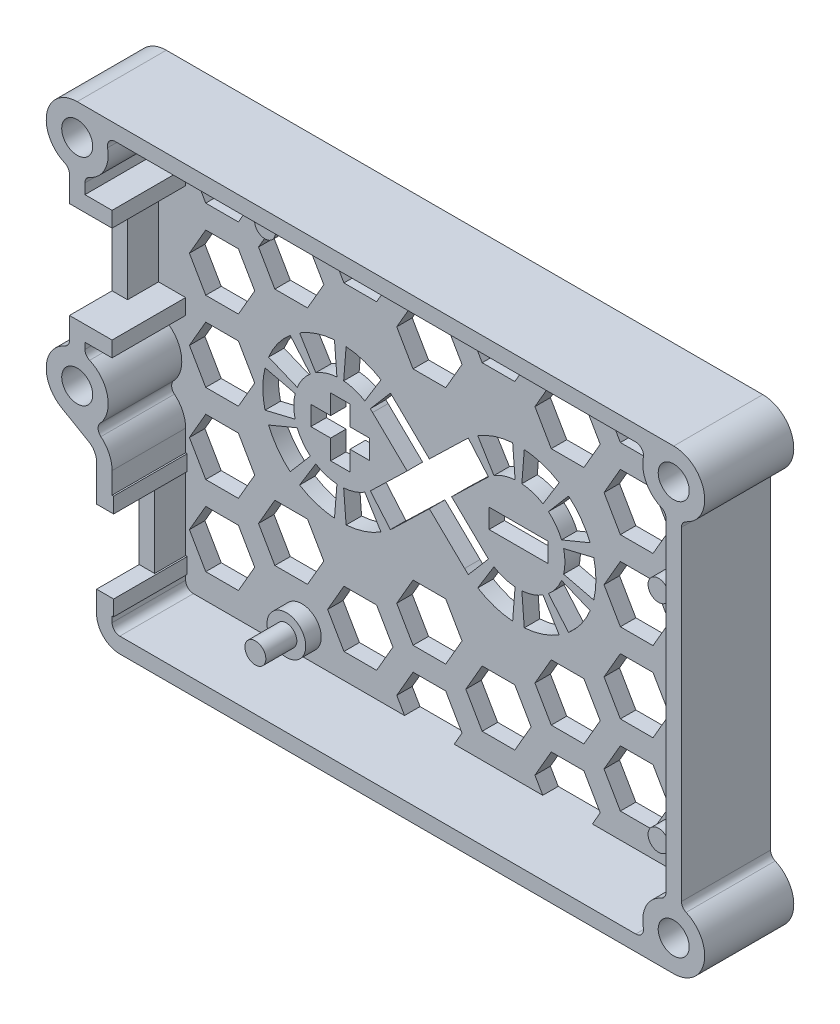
from build123d import *

# Parameters (mm, degrees)
ESQUISSE2_R             = 2
BOSS_EXTRU_1_DEPTH      = 2
ESQUISSE10_R            = 1
ENL_V_MAT_EXTRU_3_DEPTH = 52.806385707
ESQUISSE3_R             = 2
BOSS_EXTRU_2_DEPTH      = 9.5
BOSS_EXTRU_3_START      = 2
ESQUISSE4_R             = 2.5
ESQUISSE4_R_2           = 1
BOSS_EXTRU_3_DEPTH      = 2
ESQUISSE6_W             = 2
ESQUISSE6_H             = 12.5
ESQUISSE6_H_2           = 9.5
ENL_V_MAT_EXTRU_1_DEPTH = 5.5
ESQUISSE7_W             = 3.5
ESQUISSE7_H             = 2
ESQUISSE7_W_2           = 0.2
BOSS_EXTRU_4_DEPTH      = 9.5
ENL_V_MAT_EXTRU_2_DEPTH = 53.63222967
ESQUISSE13_W            = 7.599342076
ESQUISSE13_H            = 2.5
ENL_V_MAT_EXTRU_8_DEPTH = 54.029723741
ESQUISSE16_R            = 1.35
BOSS_EXTRU_5_DEPTH      = 8


with BuildPart() as part:
    # Esquisse2 → Boss.-Extru.1 (new body)
    with BuildSketch(Plane.XY):
        with BuildLine():
            Line((-40.54, -5.74722325), (-37.04, -7.767949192))
            ThreePointArc((-37.04, -7.767949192), (-36.307949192, -8.5), (-36.04, -9.5))
            Line((-36.04, -9.5), (-36.04, -26.5))
            ThreePointArc((-36.04, -26.5), (-35.161320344, -28.621320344), (-33.04, -29.5))
            Line((-33.04, -29.5), (5.406709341, -29.5))
            Line((5.406709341, -29.5), (38.46, -29.5))
            ThreePointArc((38.46, -29.5), (42.375625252, -26.317238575), (40.06, -21.833939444))
            ThreePointArc((40.06, -21.833939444), (39.623339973, -21.465146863), (39.46, -20.917424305))
            Line((39.46, -20.917424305), (39.46, 20.917424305))
            ThreePointArc((39.46, 20.917424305), (39.623339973, 21.465146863), (40.06, 21.833939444))
            ThreePointArc((40.06, 21.833939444), (42.375625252, 26.317238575), (38.46, 29.5))
            Line((38.46, 29.5), (-38.54, 29.5))
            ThreePointArc((-38.54, 29.5), (-42.455625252, 26.317238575), (-40.14, 21.833939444))
            ThreePointArc((-40.14, 21.833939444), (-39.703339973, 21.465146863), (-39.54, 20.917424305))
            Line((-39.54, 20.917424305), (-39.54, 2.29945406))
            ThreePointArc((-39.54, 2.29945406), (-39.703339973, 1.751731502), (-40.14, 1.382938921))
            ThreePointArc((-40.14, 1.382938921), (-42.533720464, -2.059075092), (-40.54, -5.74722325))
        make_face()
        with Locations((-38.54, 25.5)):
            Circle(ESQUISSE2_R, mode=Mode.SUBTRACT)
        with Locations((-38.54, -2.283121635)):
            Circle(ESQUISSE2_R, mode=Mode.SUBTRACT)
        with Locations(Location((38.46, 25.5, 0), (0, 0, 180))):
            Circle(ESQUISSE2_R, mode=Mode.SUBTRACT)
        with Locations((38.46, -25.5)):
            Circle(ESQUISSE2_R, mode=Mode.SUBTRACT)
    extrude(amount=BOSS_EXTRU_1_DEPTH)

    # Esquisse10 → Enl_v. mat.-Extru.3 (cut, through all)
    with BuildSketch(Plane.XY.offset(2)):
        with Locations((-17.8, 24.13)):
            Circle(ESQUISSE10_R)
        with Locations((33, 8.89)):
            Circle(ESQUISSE10_R)
        with Locations((33, -19.05)):
            Circle(ESQUISSE10_R)
        with Locations((-19.04, -24.13)):
            Circle(ESQUISSE10_R)
    extrude(amount=-ENL_V_MAT_EXTRU_3_DEPTH, mode=Mode.SUBTRACT)

    # Esquisse3 → Boss.-Extru.2 (add)
    with BuildSketch(Plane.XY.offset(2)):
        with BuildLine():
            Line((-39.54, 20.917424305), (-39.54, 2.29945406))
            ThreePointArc((-39.54, 2.29945406), (-39.703339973, 1.751731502), (-40.14, 1.382938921))
            ThreePointArc((-40.14, 1.382938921), (-42.533720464, -2.059075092), (-40.54, -5.74722325))
            Line((-40.54, -5.74722325), (-37.04, -7.767949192))
            ThreePointArc((-37.04, -7.767949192), (-36.307949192, -8.5), (-36.04, -9.5))
            Line((-36.04, -9.5), (-36.04, -26.5))
            ThreePointArc((-36.04, -26.5), (-35.161320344, -28.621320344), (-33.04, -29.5))
            Line((-33.04, -29.5), (38.46, -29.5))
            ThreePointArc((38.46, -29.5), (42.375625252, -26.317238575), (40.06, -21.833939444))
            ThreePointArc((40.06, -21.833939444), (39.623339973, -21.465146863), (39.46, -20.917424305))
            Line((39.46, -20.917424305), (39.46, 20.917424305))
            ThreePointArc((39.46, 20.917424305), (39.623339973, 21.465146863), (40.06, 21.833939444))
            ThreePointArc((40.06, 21.833939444), (42.375625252, 26.317238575), (38.46, 29.5))
            Line((38.46, 29.5), (-38.54, 29.5))
            ThreePointArc((-38.54, 29.5), (-42.455625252, 26.317238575), (-40.14, 21.833939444))
            ThreePointArc((-40.14, 21.833939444), (-39.703339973, 21.465146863), (-39.54, 20.917424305))
        make_face()
        with Locations((-38.54, 25.5)):
            Circle(ESQUISSE3_R, mode=Mode.SUBTRACT)
        with Locations(Location((38.46, 25.5, 0), (0, 0, 180))):
            Circle(ESQUISSE3_R, mode=Mode.SUBTRACT)
        with Locations((38.46, -25.5)):
            Circle(ESQUISSE3_R, mode=Mode.SUBTRACT)
        with Locations((-38.54, -2.283121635)):
            Circle(ESQUISSE3_R, mode=Mode.SUBTRACT)
        with BuildLine():
            Line((-37.54, 20.917424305), (-37.54, 2.29945406))
            ThreePointArc((-37.54, 2.29945406), (-37.376660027, 1.751731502), (-36.94, 1.382938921))
            ThreePointArc((-36.94, 1.382938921), (-34.627755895, -1.449847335), (-35.584962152, -4.97899836))
            ThreePointArc((-35.584962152, -4.97899836), (-35.843811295, -5.722083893), (-35.484962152, -6.422374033))
            ThreePointArc((-35.484962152, -6.422374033), (-34.419216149, -7.800022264), (-34.04, -9.5))
            Line((-34.04, -9.5), (-34.04, -26.5))
            ThreePointArc((-34.04, -26.5), (-33.747106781, -27.207106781), (-33.04, -27.5))
            Line((-33.04, -27.5), (5.406709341, -27.5))
            Line((5.406709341, -27.5), (33.561020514, -27.5))
            ThreePointArc((33.561020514, -27.5), (34.335617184, -27.132455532), (34.540816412, -26.3))
            ThreePointArc((34.540816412, -26.3), (34.910102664, -23.656571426), (36.86, -21.833939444))
            ThreePointArc((36.86, -21.833939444), (37.296660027, -21.465146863), (37.46, -20.917424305))
            Line((37.46, -20.917424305), (37.46, 20.917424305))
            ThreePointArc((37.46, 20.917424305), (37.296660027, 21.465146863), (36.86, 21.833939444))
            ThreePointArc((36.86, 21.833939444), (34.910102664, 23.656571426), (34.540816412, 26.3))
            ThreePointArc((34.540816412, 26.3), (34.335617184, 27.132455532), (33.561020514, 27.5))
            Line((33.561020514, 27.5), (-33.641020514, 27.5))
            ThreePointArc((-33.641020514, 27.5), (-34.415617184, 27.132455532), (-34.620816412, 26.3))
            ThreePointArc((-34.620816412, 26.3), (-34.990102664, 23.656571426), (-36.94, 21.833939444))
            ThreePointArc((-36.94, 21.833939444), (-37.376660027, 21.465146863), (-37.54, 20.917424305))
        make_face(mode=Mode.SUBTRACT)
    extrude(amount=BOSS_EXTRU_2_DEPTH)

    # Esquisse4 → Boss.-Extru.3 (add)
    # profile 1 of 4: a face of its own
    with BuildSketch(Plane.XY.offset(2).offset(BOSS_EXTRU_3_START)):
        with Locations(Location((-17.8, 24.13, 0), (0, 0, 180))):
            Circle(ESQUISSE4_R)
        with Locations((-17.8, 24.13)):
            Circle(ESQUISSE4_R_2, mode=Mode.SUBTRACT)
    # profile 2 of 4: a face of its own
    with BuildSketch(Plane.XY.offset(2).offset(BOSS_EXTRU_3_START)):
        with Locations(Location((-19.04, -24.13, 0), (0, 0, 180))):
            Circle(ESQUISSE4_R)
        with Locations((-19.04, -24.13)):
            Circle(ESQUISSE4_R_2, mode=Mode.SUBTRACT)
    # profile 3 of 4: a face of its own
    with BuildSketch(Plane.XY.offset(2).offset(BOSS_EXTRU_3_START)):
        with Locations(Location((33, 8.89, 0), (0, 0, 180))):
            Circle(ESQUISSE4_R)
        with Locations((33, 8.89)):
            Circle(ESQUISSE4_R_2, mode=Mode.SUBTRACT)
    # profile 4 of 4: a face of its own
    with BuildSketch(Plane.XY.offset(2).offset(BOSS_EXTRU_3_START)):
        with Locations(Location((33, -19.05, 0), (0, 0, 180))):
            Circle(ESQUISSE4_R)
        with Locations((33, -19.05)):
            Circle(ESQUISSE4_R_2, mode=Mode.SUBTRACT)
    extrude(amount=-BOSS_EXTRU_3_DEPTH)

    # Esquisse6 → Enl_v. mat.-Extru.1 (cut)
    with BuildSketch(Plane.XY.offset(11.5)):
        with Locations((-38.54, 11.35)):
            Rectangle(ESQUISSE6_W, ESQUISSE6_H)
        with Locations((-35.04, -19)):
            Rectangle(ESQUISSE6_W, ESQUISSE6_H_2)
    extrude(amount=-ENL_V_MAT_EXTRU_1_DEPTH, mode=Mode.SUBTRACT)

    # Esquisse7 → Boss.-Extru.4 (add)
    with BuildSketch(Plane.XY.offset(2)):
        with Locations((-35.79, 18.6)):
            Rectangle(ESQUISSE7_W, ESQUISSE7_H)
        with Locations((-35.79, 4.1)):
            Rectangle(ESQUISSE7_W, ESQUISSE7_H)
        with Locations((-33.94, -13.25)):
            Rectangle(ESQUISSE7_W_2, ESQUISSE7_H)
        with Locations((-33.94, -24.75)):
            Rectangle(ESQUISSE7_W_2, ESQUISSE7_H)
    extrude(amount=BOSS_EXTRU_4_DEPTH)

    # Esquisse9 → Enl_v. mat.-Extru.2 (cut, through all)
    with BuildSketch(Plane.XY.offset(2)):
        Polygon((-27.232794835, -16.95), (-31.447451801, -16.95), (-33.554780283, -20.6), (-31.447451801, -24.25), (-27.232794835, -24.25), (-25.125466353, -20.6), align=None)
        Polygon((-22.527390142, -19.1), (-18.312733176, -19.1), (-16.205404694, -15.45), (-18.312733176, -11.8), (-22.527390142, -11.8), (-24.634718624, -15.45), align=None)
        Polygon((-13.607328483, -16.95), (-15.714656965, -20.6), (-13.607328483, -24.25), (-9.392671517, -24.25), (-7.285343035, -20.6), (-9.392671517, -16.95), align=None)
        Polygon((-27.232794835, -13.95), (-25.125466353, -10.3), (-27.232794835, -6.65), (-31.447451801, -6.65), (-33.554780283, -10.3), (-31.447451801, -13.95), align=None)
        Polygon((-27.232794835, -3.65), (-25.125466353, 0), (-27.232794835, 3.65), (-31.447451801, 3.65), (-33.554780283, 0), (-31.447451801, -3.65), align=None)
        Polygon((-27.232794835, 6.65), (-25.125466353, 10.3), (-27.232794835, 13.95), (-31.447451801, 13.95), (-33.554780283, 10.3), (-31.447451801, 6.65), align=None)
        Polygon((-27.232794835, 16.95), (-25.125466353, 20.6), (-27.232794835, 24.25), (-31.447451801, 24.25), (-33.554780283, 20.6), (-31.447451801, 16.95), align=None)
        Polygon((-22.527390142, 19.1), (-24.634718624, 15.45), (-22.527390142, 11.8), (-18.312733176, 11.8), (-16.205404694, 15.45), (-18.312733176, 19.1), align=None)
        Polygon((-15.714656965, 20.6), (-13.607328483, 16.95), (-9.392671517, 16.95), (-7.285343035, 20.6), (-9.392671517, 24.25), (-13.607328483, 24.25), align=None)
        Polygon((-4.687266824, 19.1), (-6.794595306, 15.45), (-4.687266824, 11.8), (-0.472609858, 11.8), (1.634718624, 15.45), (-0.472609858, 19.1), align=None)
        Polygon((2.125466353, 20.6), (4.232794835, 16.95), (8.447451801, 16.95), (10.554780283, 20.6), (8.447451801, 24.25), (4.232794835, 24.25), align=None)
        Polygon((13.152856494, 19.1), (11.045528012, 15.45), (13.152856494, 11.8), (17.367513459, 11.8), (19.474841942, 15.45), (17.367513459, 19.1), align=None)
        Polygon((-6.794595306, -15.45), (-4.687266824, -19.1), (-0.472609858, -19.1), (1.634718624, -15.45), (-0.472609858, -11.8), (-4.687266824, -11.8), align=None)
        Polygon((2.125466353, -20.6), (4.232794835, -24.25), (8.447451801, -24.25), (10.554780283, -20.6), (8.447451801, -16.95), (4.232794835, -16.95), align=None)
        Polygon((19.965589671, -20.6), (22.072918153, -24.25), (26.287575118, -24.25), (28.394903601, -20.6), (26.287575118, -16.95), (22.072918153, -16.95), align=None)
        Polygon((17.367513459, -19.1), (19.474841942, -15.45), (17.367513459, -11.8), (13.152856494, -11.8), (11.045528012, -15.45), (13.152856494, -19.1), align=None)
        Polygon((22.072918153, -13.95), (26.287575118, -13.95), (28.394903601, -10.3), (26.287575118, -6.65), (22.072918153, -6.65), (19.965589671, -10.3), align=None)
        Polygon((19.965589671, 20.6), (22.072918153, 16.95), (26.287575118, 16.95), (28.394903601, 20.6), (26.287575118, 24.25), (22.072918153, 24.25), align=None)
        Polygon((22.072918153, 13.95), (19.965589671, 10.3), (22.072918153, 6.65), (26.287575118, 6.65), (28.394903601, 10.3), (26.287575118, 13.95), align=None)
        Polygon((22.072918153, 3.65), (19.965589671, 0), (22.072918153, -3.65), (26.287575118, -3.65), (28.394903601, 0), (26.287575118, 3.65), align=None)
        Polygon((30.992979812, -8.8), (35.207636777, -8.8), (37.31496526, -5.15), (35.207636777, -1.5), (30.992979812, -1.5), (28.88565133, -5.15), align=None)
        Polygon((0.624355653, -27.5), (-5.784232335, -27.5), (-6.794595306, -25.75), (-4.687266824, -22.1), (-0.472609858, -22.1), (1.634718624, -25.75), align=None)
        Polygon((12.055890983, -27.5), (18.464478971, -27.5), (19.474841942, -25.75), (17.367513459, -22.1), (13.152856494, -22.1), (11.045528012, -25.75), align=None)
        Polygon((-6.794595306, 25.75), (-4.687266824, 22.1), (-0.472609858, 22.1), (1.634718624, 25.75), (0.624355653, 27.5), (-5.784232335, 27.5), align=None)
        Polygon((12.055890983, 27.5), (18.464478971, 27.5), (19.474841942, 25.75), (17.367513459, 22.1), (13.152856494, 22.1), (11.045528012, 25.75), align=None)
    extrude(amount=-ENL_V_MAT_EXTRU_2_DEPTH, mode=Mode.SUBTRACT)

    # Esquisse13 → Enl_v. mat.-Extru.8 (cut, through all)
    with BuildSketch(Plane(origin=(0, 0, 0), x_dir=(1, 0, 0), z_dir=(0, 0, -1))):
        with BuildLine():
            Line((4.746148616, -4.310272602), (0.295061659, 0))
            Line((0.295061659, 0), (4.746148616, 4.310272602))
            ThreePointArc((4.746148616, 4.310272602), (4.895865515, 4.450375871), (5.050282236, 4.585281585))
            Line((5.050282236, 4.585281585), (2.452001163, 7.626545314))
            ThreePointArc((2.452001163, 7.626545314), (2.204120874, 7.409192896), (1.96353992, 7.18378767))
            Line((1.96353992, 7.18378767), (-2.579938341, 2.78404665))
            Line((-2.579938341, 2.78404665), (-7.123416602, 7.18378767))
            ThreePointArc((-7.123416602, 7.18378767), (-7.363997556, 7.409192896), (-7.611877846, 7.626545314))
            Line((-7.611877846, 7.626545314), (-10.210158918, 4.585281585))
            ThreePointArc((-10.210158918, 4.585281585), (-10.055742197, 4.450375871), (-9.906025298, 4.310272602))
            Line((-9.906025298, 4.310272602), (-5.454938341, 0))
            Line((-5.454938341, 0), (-9.906025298, -4.310272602))
            ThreePointArc((-9.906025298, -4.310272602), (-10.055742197, -4.450375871), (-10.210158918, -4.585281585))
            Line((-10.210158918, -4.585281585), (-7.611877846, -7.626545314))
            ThreePointArc((-7.611877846, -7.626545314), (-7.363997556, -7.409192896), (-7.123416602, -7.18378767))
            Line((-7.123416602, -7.18378767), (-2.579938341, -2.78404665))
            Line((-2.579938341, -2.78404665), (1.96353992, -7.18378767))
            ThreePointArc((1.96353992, -7.18378767), (2.204120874, -7.409192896), (2.452001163, -7.626545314))
            Line((2.452001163, -7.626545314), (5.050282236, -4.585281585))
            ThreePointArc((5.050282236, -4.585281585), (4.895865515, -4.450375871), (4.746148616, -4.310272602))
        make_face()
        with BuildLine():
            Line((9.670061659, -9.971835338), (9.355618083, -5.984170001))
            ThreePointArc((9.355618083, -5.984170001), (10.774163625, -5.706339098), (12.085095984, -5.097308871))
            Line((12.085095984, -5.097308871), (14.174596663, -8.508223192))
            ThreePointArc((14.174596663, -8.508223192), (12.010231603, -9.510565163), (9.670061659, -9.971835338))
        make_face()
        with BuildLine():
            Line((3.665526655, -8.508223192), (5.755027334, -5.097308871))
            ThreePointArc((5.755027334, -5.097308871), (7.065959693, -5.706339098), (8.484505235, -5.984170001))
            Line((8.484505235, -5.984170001), (8.170061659, -9.971835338))
            ThreePointArc((8.170061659, -9.971835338), (5.829891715, -9.510565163), (3.665526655, -8.508223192))
        make_face()
        with BuildLine():
            Line((5.755027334, 5.097308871), (3.665526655, 8.508223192))
            ThreePointArc((3.665526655, 8.508223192), (5.829891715, 9.510565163), (8.170061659, 9.971835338))
            Line((8.170061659, 9.971835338), (8.484505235, 5.984170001))
            ThreePointArc((8.484505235, 5.984170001), (7.065959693, 5.706339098), (5.755027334, 5.097308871))
        make_face()
        with BuildLine():
            Line((9.355618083, 5.984170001), (9.670061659, 9.971835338))
            ThreePointArc((9.670061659, 9.971835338), (12.010231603, 9.510565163), (14.174596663, 8.508223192))
            Line((14.174596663, 8.508223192), (12.085095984, 5.097308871))
            ThreePointArc((12.085095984, 5.097308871), (10.774163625, 5.706339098), (9.355618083, 5.984170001))
        make_face()
        with BuildLine():
            Line((12.789841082, 4.585281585), (15.388122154, 7.626545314))
            ThreePointArc((15.388122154, 7.626545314), (17.010231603, 5.877852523), (18.17207789, 3.794758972))
            Line((18.17207789, 3.794758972), (14.476751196, 2.263449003))
            ThreePointArc((14.476751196, 2.263449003), (13.774163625, 3.526711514), (12.789841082, 4.585281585))
        make_face()
        with BuildLine():
            Line((14.74593987, 1.434971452), (18.635603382, 2.368174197))
            ThreePointArc((18.635603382, 2.368174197), (18.920061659, 0), (18.635603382, -2.368174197))
            Line((18.635603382, -2.368174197), (14.74593987, -1.434971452))
            ThreePointArc((14.74593987, -1.434971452), (14.920061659, 0), (14.74593987, 1.434971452))
        make_face()
        with BuildLine():
            Line((14.476751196, -2.263449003), (18.17207789, -3.794758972))
            ThreePointArc((18.17207789, -3.794758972), (17.010231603, -5.877852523), (15.388122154, -7.626545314))
            Line((15.388122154, -7.626545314), (12.789841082, -4.585281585))
            ThreePointArc((12.789841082, -4.585281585), (13.774163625, -3.526711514), (14.476751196, -2.263449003))
        make_face()
        with BuildLine():
            Line((-17.244972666, -5.097308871), (-19.334473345, -8.508223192))
            ThreePointArc((-19.334473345, -8.508223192), (-17.170108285, -9.510565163), (-14.829938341, -9.971835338))
            Line((-14.829938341, -9.971835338), (-14.515494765, -5.984170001))
            ThreePointArc((-14.515494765, -5.984170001), (-15.934040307, -5.706339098), (-17.244972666, -5.097308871))
        make_face()
        with BuildLine():
            Line((-20.547998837, -7.626545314), (-17.949717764, -4.585281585))
            ThreePointArc((-17.949717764, -4.585281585), (-18.934040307, -3.526711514), (-19.636627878, -2.263449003))
            Line((-19.636627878, -2.263449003), (-23.331954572, -3.794758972))
            ThreePointArc((-23.331954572, -3.794758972), (-22.170108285, -5.877852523), (-20.547998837, -7.626545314))
        make_face()
        with BuildLine():
            Line((-23.795480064, -2.368174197), (-19.905816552, -1.434971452))
            ThreePointArc((-19.905816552, -1.434971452), (-20.079938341, 0), (-19.905816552, 1.434971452))
            Line((-19.905816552, 1.434971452), (-23.795480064, 2.368174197))
            ThreePointArc((-23.795480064, 2.368174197), (-24.079938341, 0), (-23.795480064, -2.368174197))
        make_face()
        with BuildLine():
            Line((-23.331954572, 3.794758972), (-19.636627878, 2.263449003))
            ThreePointArc((-19.636627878, 2.263449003), (-18.934040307, 3.526711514), (-17.949717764, 4.585281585))
            Line((-17.949717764, 4.585281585), (-20.547998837, 7.626545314))
            ThreePointArc((-20.547998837, 7.626545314), (-22.170108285, 5.877852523), (-23.331954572, 3.794758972))
        make_face()
        with BuildLine():
            Line((-19.334473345, 8.508223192), (-17.244972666, 5.097308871))
            ThreePointArc((-17.244972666, 5.097308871), (-15.934040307, 5.706339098), (-14.515494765, 5.984170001))
            Line((-14.515494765, 5.984170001), (-14.829938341, 9.971835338))
            ThreePointArc((-14.829938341, 9.971835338), (-17.170108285, 9.510565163), (-19.334473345, 8.508223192))
        make_face()
        with BuildLine():
            Line((-13.329938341, 9.971835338), (-13.644381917, 5.984170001))
            ThreePointArc((-13.644381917, 5.984170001), (-12.225836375, 5.706339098), (-10.914904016, 5.097308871))
            Line((-10.914904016, 5.097308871), (-8.825403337, 8.508223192))
            ThreePointArc((-8.825403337, 8.508223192), (-10.989768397, 9.510565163), (-13.329938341, 9.971835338))
        make_face()
        with BuildLine():
            Line((-13.644381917, -5.984170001), (-13.329938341, -9.971835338))
            ThreePointArc((-13.329938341, -9.971835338), (-10.989768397, -9.510565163), (-8.825403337, -8.508223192))
            Line((-8.825403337, -8.508223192), (-10.914904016, -5.097308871))
            ThreePointArc((-10.914904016, -5.097308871), (-12.225836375, -5.706339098), (-13.644381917, -5.984170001))
        make_face()
        Polygon((-12.829938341, -1.25), (-12.829938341, -3.799671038), (-15.329938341, -3.799671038), (-15.329938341, -1.25), (-17.879609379, -1.25), (-17.879609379, 1.25), (-15.329938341, 1.25), (-15.329938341, 3.799671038), (-12.829938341, 3.799671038), (-12.829938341, 1.25), (-10.280267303, 1.25), (-10.280267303, -1.25), align=None)
        with Locations((8.920061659, 0)):
            Rectangle(ESQUISSE13_W, ESQUISSE13_H)
    extrude(amount=-ENL_V_MAT_EXTRU_8_DEPTH, mode=Mode.SUBTRACT)

    # Esquisse16 → Boss.-Extru.5 (add)
    with BuildSketch(Plane(origin=(0, 0, 0), x_dir=(1, 0, 0), z_dir=(0, 0, -1))):
        with Locations(Location((-19.04, 24.13, 0), (0, 0, 270))):
            Circle(ESQUISSE16_R)
        with Locations(Location((33, 19.05, 0), (0, 0, 270))):
            Circle(ESQUISSE16_R)
        with Locations(Location((33, -8.89, 0), (0, 0, 270))):
            Circle(ESQUISSE16_R)
        with Locations(Location((-17.8, -24.13, 0), (0, 0, 270))):
            Circle(ESQUISSE16_R)
    extrude(amount=-BOSS_EXTRU_5_DEPTH)


solid = part.part
